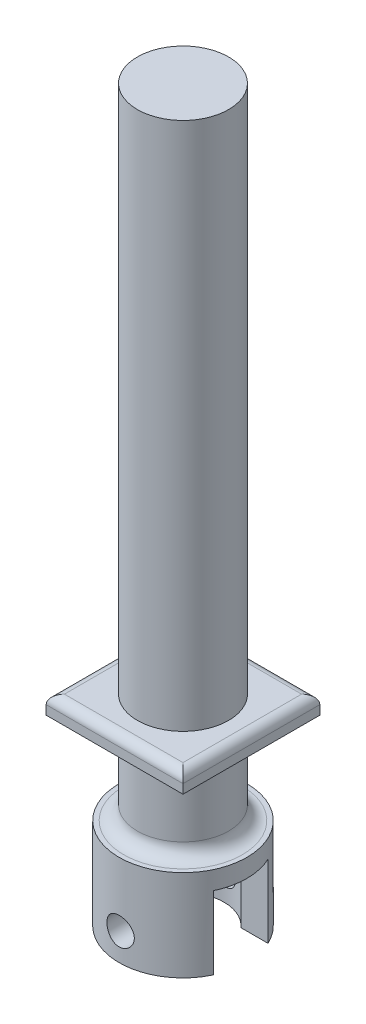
from build123d import *

# Parameters (mm, degrees)
SKETCH1_W               = 5
SKETCH1_H               = 70
BOSS_EXTRUDE1_START     = 2
SKETCH5_W               = 15
SKETCH5_H               = 15
SKETCH5_R               = 5
BOSS_EXTRUDE1_DEPTH     = 2
SKETCH6_R               = 4.5
BOSS_EXTRUDE3_DEPTH     = 10
FILLET6_R               = 1.5
SKETCH7_W               = 21.557428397
SKETCH7_H               = 6
CUT_EXTRUDE1_DEPTH      = 8
CUT_EXTRUDE2_DEPTH      = 87.795505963
CUT_EXTRUDE2_DEPTH_BACK = 87.795505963
SKETCH9_R               = 1.5
FILLET7_R               = 1


with BuildPart() as part:
    # Sketch1 → Revolve1 (revolve)
    with BuildSketch(Plane.XY, mode=Mode.PRIVATE) as revolve1_sk:
        with Locations((2.5, 51.144993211)):
            Rectangle(SKETCH1_W, SKETCH1_H)
    revolve(revolve1_sk.sketch.rotate(Axis((0, 86.144993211, 0), (0, -1, 0)), 90), axis=Axis((0, 86.144993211, 0), (0, -1, 0)))

    # Sketch5 → Boss-Extrude1 (add)
    with BuildSketch(Plane(origin=(0, 28.144993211, 0), x_dir=(-1, 0, 0), z_dir=(0, -1, 0)).offset(BOSS_EXTRUDE1_START)):
        Rectangle(SKETCH5_W, SKETCH5_H)
        with Locations(Location((0, 0, 0), (0, 0, 270))):
            Circle(SKETCH5_R, mode=Mode.SUBTRACT)
    extrude(amount=-BOSS_EXTRUDE1_DEPTH)

    # Sketch6 → Boss-Extrude3 (add)
    with BuildSketch(Plane.XZ.offset(-16.144993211)):
        with BuildLine():
            ThreePointArc((-6.32455532, -3), (0, -7), (6.32455532, -3))
            ThreePointArc((6.32455532, -3), (0, 7), (-6.32455532, -3))
        make_face()
        with Locations(Location((0, 0, 0), (0, 0, 270))):
            Circle(SKETCH6_R, mode=Mode.SUBTRACT)
    extrude(amount=BOSS_EXTRUDE3_DEPTH)

    # Fillet6
    fillet6_edges = [part.edges().sort_by_distance(p)[0] for p in [
        (0, 16.144993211, -5),
    ]]
    fillet(fillet6_edges, radius=FILLET6_R)

    # Sketch7 → Cut-Extrude1 (cut)
    with BuildSketch(Plane.XZ.offset(-6.144993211)):
        with Locations((-0.157037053, 0)):
            Rectangle(SKETCH7_W, SKETCH7_H)
    extrude(amount=-CUT_EXTRUDE1_DEPTH, mode=Mode.SUBTRACT)

    # Sketch9 → Cut-Extrude2 (cut, two sides: drawn at the far end of the back side and taken through both)
    with BuildSketch(Plane.XY.offset(-CUT_EXTRUDE2_DEPTH_BACK)):
        with Locations((0, 9.144993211)):
            Circle(SKETCH9_R)
    extrude(amount=CUT_EXTRUDE2_DEPTH + CUT_EXTRUDE2_DEPTH_BACK, mode=Mode.SUBTRACT)

    # Fillet7
    fillet7_edges = [part.edges().sort_by_distance(p)[0] for p in [
        (-7.5, 28.144993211, 0),
        (0, 28.144993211, -7.5),
        (7.5, 28.144993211, 0),
        (0, 28.144993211, 7.5),
    ]]
    fillet(fillet7_edges, radius=FILLET7_R)


solid = part.part
